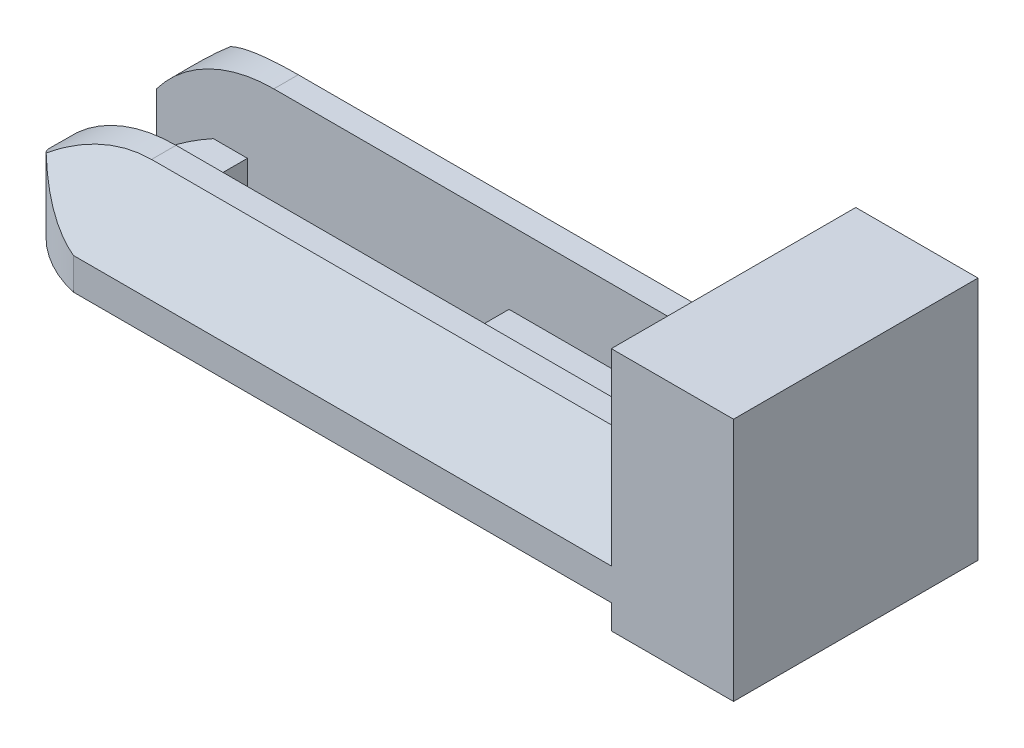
ISO-10303-21;
HEADER;
FILE_DESCRIPTION(('STEP AP214'),'2;1');
FILE_NAME('part.step','',(''),(''),'','','');
FILE_SCHEMA(('AUTOMOTIVE_DESIGN { 1 0 10303 214 1 1 1 1 }'));
ENDSEC;
DATA;
#1=APPLICATION_CONTEXT('core data for automotive mechanical design processes');
#2=APPLICATION_PROTOCOL_DEFINITION('international standard','automotive_design',2000,#1);
#3=PRODUCT_CONTEXT('',#1,'mechanical');
#4=PRODUCT('Part','Part','',(#3));
#5=PRODUCT_RELATED_PRODUCT_CATEGORY('part','',(#4));
#6=PRODUCT_DEFINITION_FORMATION('','',#4);
#7=PRODUCT_DEFINITION_CONTEXT('part definition',#1,'design');
#8=PRODUCT_DEFINITION('design','',#6,#7);
#9=PRODUCT_DEFINITION_SHAPE('','',#8);
#10=(LENGTH_UNIT() NAMED_UNIT(*) SI_UNIT(.MILLI.,.METRE.));
#11=(NAMED_UNIT(*) PLANE_ANGLE_UNIT() SI_UNIT($,.RADIAN.));
#12=(NAMED_UNIT(*) SI_UNIT($,.STERADIAN.) SOLID_ANGLE_UNIT());
#13=UNCERTAINTY_MEASURE_WITH_UNIT(LENGTH_MEASURE(1.E-05),#10,'distance_accuracy_value','');
#14=(GEOMETRIC_REPRESENTATION_CONTEXT(3) GLOBAL_UNCERTAINTY_ASSIGNED_CONTEXT((#13)) GLOBAL_UNIT_ASSIGNED_CONTEXT((#10,
#11,#12)) REPRESENTATION_CONTEXT('',''));
#15=CARTESIAN_POINT('',(0.,0.,0.));
#16=DIRECTION('',(0.,0.,1.));
#17=DIRECTION('',(1.,0.,0.));
#18=AXIS2_PLACEMENT_3D('',#15,#16,#17);
#19=CARTESIAN_POINT('',(1.125,2.3,-5.));
#20=DIRECTION('',(0.,1.,0.));
#21=DIRECTION('',(0.,0.,1.));
#22=AXIS2_PLACEMENT_3D('',#19,#20,#21);
#23=PLANE('',#22);
#24=DIRECTION('',(1.,0.,0.));
#25=VECTOR('',#24,1.);
#26=CARTESIAN_POINT('',(-4.,2.3,-7.));
#27=LINE('',#26,#25);
#28=CARTESIAN_POINT('',(10.8172177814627,2.3,-7.));
#29=VERTEX_POINT('',#28);
#30=CARTESIAN_POINT('',(22.,2.3,-7.));
#31=VERTEX_POINT('',#30);
#32=EDGE_CURVE('E300',#29,#31,#27,.T.);
#33=ORIENTED_EDGE('',*,*,#32,.F.);
#34=DIRECTION('',(0.,0.,-1.));
#35=VECTOR('',#34,1.);
#36=CARTESIAN_POINT('',(10.8172177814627,2.3,-5.));
#37=LINE('',#36,#35);
#38=CARTESIAN_POINT('',(10.8172177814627,2.3,-3.));
#39=VERTEX_POINT('',#38);
#40=EDGE_CURVE('E470',#29,#39,#37,.F.);
#41=ORIENTED_EDGE('',*,*,#40,.T.);
#42=DIRECTION('',(-1.,0.,0.));
#43=VECTOR('',#42,1.);
#44=CARTESIAN_POINT('',(1.125,2.3,-3.));
#45=LINE('',#44,#43);
#46=CARTESIAN_POINT('',(22.,2.3,-3.));
#47=VERTEX_POINT('',#46);
#48=EDGE_CURVE('E327',#47,#39,#45,.T.);
#49=ORIENTED_EDGE('',*,*,#48,.F.);
#50=DIRECTION('',(0.,0.,-1.));
#51=VECTOR('',#50,1.);
#52=CARTESIAN_POINT('',(22.,2.3,0.));
#53=LINE('',#52,#51);
#54=EDGE_CURVE('E291',#47,#31,#53,.T.);
#55=ORIENTED_EDGE('',*,*,#54,.T.);
#56=EDGE_LOOP('',(#33,#41,#49,#55));
#57=FACE_BOUND('',#56,.T.);
#58=ADVANCED_FACE('F34',(#57),#23,.T.);
#59=CARTESIAN_POINT('',(1.125,2.3,-5.));
#60=DIRECTION('',(0.,-1.,0.));
#61=DIRECTION('',(0.,0.,-1.));
#62=AXIS2_PLACEMENT_3D('',#59,#60,#61);
#63=CYLINDRICAL_SURFACE('',#62,5.125);
#64=DIRECTION('',(0.,-1.,0.));
#65=VECTOR('',#64,1.);
#66=CARTESIAN_POINT('',(-3.59364652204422,5.3,-3.));
#67=LINE('',#66,#65);
#68=CARTESIAN_POINT('',(-3.59364652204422,2.91356141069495,-3.));
#69=VERTEX_POINT('',#68);
#70=CARTESIAN_POINT('',(-3.59364652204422,1.,-3.));
#71=VERTEX_POINT('',#70);
#72=EDGE_CURVE('E520',#69,#71,#67,.T.);
#73=ORIENTED_EDGE('',*,*,#72,.T.);
#74=CARTESIAN_POINT('',(1.125,1.,-5.));
#75=DIRECTION('',(0.,1.,0.));
#76=DIRECTION('',(0.,0.,1.));
#77=AXIS2_PLACEMENT_3D('',#74,#75,#76);
#78=CIRCLE('',#77,5.125);
#79=CARTESIAN_POINT('',(0.,1.,0.));
#80=VERTEX_POINT('',#79);
#81=EDGE_CURVE('E299',#71,#80,#78,.T.);
#82=ORIENTED_EDGE('',*,*,#81,.T.);
#83=DIRECTION('',(0.,-1.,0.));
#84=VECTOR('',#83,1.);
#85=CARTESIAN_POINT('',(0.,2.3,0.));
#86=LINE('',#85,#84);
#87=CARTESIAN_POINT('',(0.,2.3,0.));
#88=VERTEX_POINT('',#87);
#89=EDGE_CURVE('E288',#88,#80,#86,.T.);
#90=ORIENTED_EDGE('',*,*,#89,.F.);
#91=CARTESIAN_POINT('',(1.12500000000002,9.80000000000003,-5.00000000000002));
#92=DIRECTION('',(0.,0.554700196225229,0.832050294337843));
#93=DIRECTION('',(0.,-0.832050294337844,0.554700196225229));
#94=AXIS2_PLACEMENT_3D('',#91,#92,#93);
#95=ELLIPSE('',#94,9.23922514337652,5.12500000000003);
#96=CARTESIAN_POINT('',(-2.34544004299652,4.14325539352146,-1.2288369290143));
#97=VERTEX_POINT('',#96);
#98=EDGE_CURVE('E296',#88,#97,#95,.F.);
#99=ORIENTED_EDGE('',*,*,#98,.T.);
#100=CARTESIAN_POINT('',(0.,5.17955945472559,0.));
#101=CARTESIAN_POINT('',(-0.13465374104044,5.15219339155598,-0.0302731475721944));
#102=CARTESIAN_POINT('',(-0.267134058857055,5.12039808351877,-0.0658175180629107));
#103=CARTESIAN_POINT('',(-0.526701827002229,5.04889349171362,-0.146559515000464));
#104=CARTESIAN_POINT('',(-0.653796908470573,5.00919589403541,-0.191742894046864));
#105=CARTESIAN_POINT('',(-0.900609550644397,4.92321211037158,-0.290432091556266));
#106=CARTESIAN_POINT('',(-1.02039192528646,4.87700164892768,-0.343842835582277));
#107=CARTESIAN_POINT('',(-1.2535853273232,4.77857664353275,-0.458541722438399));
#108=CARTESIAN_POINT('',(-1.36699403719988,4.72635993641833,-0.519832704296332));
#109=CARTESIAN_POINT('',(-1.58638369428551,4.61718130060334,-0.649122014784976));
#110=CARTESIAN_POINT('',(-1.69240632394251,4.5602507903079,-0.717076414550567));
#111=CARTESIAN_POINT('',(-1.89761272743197,4.44223933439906,-0.859344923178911));
#112=CARTESIAN_POINT('',(-1.99679727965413,4.38115886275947,-0.933658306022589));
#113=CARTESIAN_POINT('',(-2.18875529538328,4.25536404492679,-1.08848712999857));
#114=CARTESIAN_POINT('',(-2.28149446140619,4.19063315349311,-1.16903154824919));
#115=CARTESIAN_POINT('',(-2.46003025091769,4.05864017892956,-1.33556438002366));
#116=CARTESIAN_POINT('',(-2.54582588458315,3.99137773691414,-1.42155356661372));
#117=CARTESIAN_POINT('',(-2.72993524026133,3.8390825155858,-1.61955027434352));
#118=CARTESIAN_POINT('',(-2.82642772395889,3.75360070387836,-1.73291041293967));
#119=CARTESIAN_POINT('',(-3.00892064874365,3.58171397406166,-1.96711802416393));
#120=CARTESIAN_POINT('',(-3.09492024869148,3.49530898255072,-2.08796609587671));
#121=CARTESIAN_POINT('',(-3.25579890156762,3.32415161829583,-2.33618137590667));
#122=CARTESIAN_POINT('',(-3.33076063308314,3.23939157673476,-2.46348937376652));
#123=CARTESIAN_POINT('',(-3.43531824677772,3.11476433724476,-2.66020646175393));
#124=CARTESIAN_POINT('',(-3.46885952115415,3.07363682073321,-2.72674480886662));
#125=CARTESIAN_POINT('',(-3.53327033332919,2.99259359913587,-2.86183896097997));
#126=CARTESIAN_POINT('',(-3.56413940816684,2.95267810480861,-2.93039511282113));
#127=CARTESIAN_POINT('',(-3.59364652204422,2.91356141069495,-3.));
#128=B_SPLINE_CURVE_WITH_KNOTS('',3,(#100,#101,#102,#103,#104,#105,#106,#107,#108,#109,#110,
#111,#112,#113,#114,#115,#116,#117,#118,#119,#120,#121,#122,#123,#124,#125,#126,#127),
.UNSPECIFIED.,.F.,.F.,(4,2,2,2,2,2,2,2,2,2,2,2,2,4),(0.,0.42180022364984,0.842981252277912,
1.25961706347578,1.67640339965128,2.09060636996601,2.5047621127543,2.92097533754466,
3.33724779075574,3.85171639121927,4.36622620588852,4.87666119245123,5.13192872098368,
5.3872403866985),.UNSPECIFIED.);
#129=EDGE_CURVE('E552',#97,#69,#128,.T.);
#130=ORIENTED_EDGE('',*,*,#129,.T.);
#131=EDGE_LOOP('',(#73,#82,#90,#99,#130));
#132=FACE_BOUND('',#131,.T.);
#133=ADVANCED_FACE('F295',(#132),#63,.T.);
#134=CARTESIAN_POINT('',(0.,1.,-10.));
#135=VERTEX_POINT('',#134);
#136=CARTESIAN_POINT('',(-3.59364652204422,1.,-7.));
#137=VERTEX_POINT('',#136);
#138=EDGE_CURVE('E607',#135,#137,#78,.T.);
#139=ORIENTED_EDGE('',*,*,#138,.T.);
#140=DIRECTION('',(0.,-1.,0.));
#141=VECTOR('',#140,1.);
#142=CARTESIAN_POINT('',(-3.59364652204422,5.3,-7.));
#143=LINE('',#142,#141);
#144=CARTESIAN_POINT('',(-3.59364652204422,2.91356141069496,-7.));
#145=VERTEX_POINT('',#144);
#146=EDGE_CURVE('E516',#145,#137,#143,.T.);
#147=ORIENTED_EDGE('',*,*,#146,.F.);
#148=CARTESIAN_POINT('',(-3.59364652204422,2.91356141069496,-7.));
#149=CARTESIAN_POINT('',(-3.55588890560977,2.96362530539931,-7.08904908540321));
#150=CARTESIAN_POINT('',(-3.51590522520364,3.0149769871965,-7.17639951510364));
#151=CARTESIAN_POINT('',(-3.43158764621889,3.11948906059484,-7.34782692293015));
#152=CARTESIAN_POINT('',(-3.38725486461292,3.17264898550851,-7.43190473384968));
#153=CARTESIAN_POINT('',(-3.29427275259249,3.28009349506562,-7.597042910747));
#154=CARTESIAN_POINT('',(-3.24561893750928,3.33437920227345,-7.67810001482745));
#155=CARTESIAN_POINT('',(-3.14407067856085,3.44343060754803,-7.83717543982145));
#156=CARTESIAN_POINT('',(-3.09117591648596,3.49819634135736,-7.91519353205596));
#157=CARTESIAN_POINT('',(-2.92472262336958,3.66383761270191,-8.14671988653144));
#158=CARTESIAN_POINT('',(-2.80457557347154,3.77466477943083,-8.29560372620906));
#159=CARTESIAN_POINT('',(-2.54687629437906,3.99235392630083,-8.58047288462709));
#160=CARTESIAN_POINT('',(-2.4093365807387,4.09921868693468,-8.71646735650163));
#161=CARTESIAN_POINT('',(-2.16593036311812,4.27096872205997,-8.93092069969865));
#162=CARTESIAN_POINT('',(-2.06496921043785,4.33788474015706,-9.01334722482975));
#163=CARTESIAN_POINT('',(-1.85532280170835,4.46756090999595,-9.17139446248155));
#164=CARTESIAN_POINT('',(-1.74663815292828,4.53032138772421,-9.2470157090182));
#165=CARTESIAN_POINT('',(-1.52246960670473,4.65024609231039,-9.39022635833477));
#166=CARTESIAN_POINT('',(-1.40703955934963,4.70744694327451,-9.45786905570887));
#167=CARTESIAN_POINT('',(-1.16903199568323,4.81570443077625,-9.58489232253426));
#168=CARTESIAN_POINT('',(-1.04645718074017,4.86676336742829,-9.64427598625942));
#169=CARTESIAN_POINT('',(-0.775570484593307,4.96888538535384,-9.76218508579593));
#170=CARTESIAN_POINT('',(-0.626162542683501,5.01879119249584,-9.81923459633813));
#171=CARTESIAN_POINT('',(-0.395951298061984,5.08546898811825,-9.89478467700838));
#172=CARTESIAN_POINT('',(-0.317960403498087,5.10638051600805,-9.91835146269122));
#173=CARTESIAN_POINT('',(-0.160236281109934,5.14523829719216,-9.96190373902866));
#174=CARTESIAN_POINT('',(-0.0805025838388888,5.16318374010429,-9.98188825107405));
#175=CARTESIAN_POINT('',(0.,5.17955945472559,-10.));
#176=B_SPLINE_CURVE_WITH_KNOTS('',3,(#148,#149,#150,#151,#152,#153,#154,#155,#156,#157,#158,
#159,#160,#161,#162,#163,#164,#165,#166,#167,#168,#169,#170,#171,#172,#173,#174,#175),
.UNSPECIFIED.,.F.,.F.,(4,2,2,2,2,2,2,2,2,2,2,2,2,4),(0.,0.326654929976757,0.653226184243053,
0.980140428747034,1.30707922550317,1.96926221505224,2.63097138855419,3.07013006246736,
3.50925424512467,3.94525556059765,4.38109308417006,4.88256386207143,5.13477977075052,
5.38706447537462),.UNSPECIFIED.);
#177=CARTESIAN_POINT('',(-2.34544004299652,4.14325539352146,-8.7711630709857));
#178=VERTEX_POINT('',#177);
#179=EDGE_CURVE('E339',#145,#178,#176,.T.);
#180=ORIENTED_EDGE('',*,*,#179,.T.);
#181=CARTESIAN_POINT('',(1.12500000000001,9.80000000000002,-4.99999999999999));
#182=DIRECTION('',(0.,0.554700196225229,-0.832050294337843));
#183=DIRECTION('',(0.,-0.832050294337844,-0.554700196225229));
#184=AXIS2_PLACEMENT_3D('',#181,#182,#183);
#185=ELLIPSE('',#184,9.2392251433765,5.12500000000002);
#186=CARTESIAN_POINT('',(0.,2.3,-10.));
#187=VERTEX_POINT('',#186);
#188=EDGE_CURVE('E347',#178,#187,#185,.F.);
#189=ORIENTED_EDGE('',*,*,#188,.T.);
#190=DIRECTION('',(0.,-1.,0.));
#191=VECTOR('',#190,1.);
#192=CARTESIAN_POINT('',(0.,2.3,-10.));
#193=LINE('',#192,#191);
#194=EDGE_CURVE('E301',#187,#135,#193,.T.);
#195=ORIENTED_EDGE('',*,*,#194,.T.);
#196=EDGE_LOOP('',(#139,#147,#180,#189,#195));
#197=FACE_BOUND('',#196,.T.);
#198=ADVANCED_FACE('F424',(#197),#63,.T.);
#199=CARTESIAN_POINT('',(0.,2.3,0.));
#200=DIRECTION('',(0.,0.,-1.));
#201=DIRECTION('',(-1.,0.,0.));
#202=AXIS2_PLACEMENT_3D('',#199,#200,#201);
#203=PLANE('',#202);
#204=ORIENTED_EDGE('',*,*,#89,.T.);
#205=DIRECTION('',(1.,0.,0.));
#206=VECTOR('',#205,1.);
#207=CARTESIAN_POINT('',(0.,1.,0.));
#208=LINE('',#207,#206);
#209=CARTESIAN_POINT('',(22.,1.,0.));
#210=VERTEX_POINT('',#209);
#211=EDGE_CURVE('E546',#80,#210,#208,.T.);
#212=ORIENTED_EDGE('',*,*,#211,.T.);
#213=DIRECTION('',(0.,-1.,0.));
#214=VECTOR('',#213,1.);
#215=CARTESIAN_POINT('',(22.,10.,0.));
#216=LINE('',#215,#214);
#217=CARTESIAN_POINT('',(22.,0.,0.));
#218=VERTEX_POINT('',#217);
#219=EDGE_CURVE('E234',#210,#218,#216,.T.);
#220=ORIENTED_EDGE('',*,*,#219,.T.);
#221=DIRECTION('',(-1.,0.,0.));
#222=VECTOR('',#221,1.);
#223=CARTESIAN_POINT('',(27.,0.,0.));
#224=LINE('',#223,#222);
#225=CARTESIAN_POINT('',(27.,0.,0.));
#226=VERTEX_POINT('',#225);
#227=EDGE_CURVE('E213',#226,#218,#224,.T.);
#228=ORIENTED_EDGE('',*,*,#227,.F.);
#229=DIRECTION('',(0.,-1.,0.));
#230=VECTOR('',#229,1.);
#231=CARTESIAN_POINT('',(27.,10.,0.));
#232=LINE('',#231,#230);
#233=CARTESIAN_POINT('',(27.,10.,0.));
#234=VERTEX_POINT('',#233);
#235=EDGE_CURVE('E219',#234,#226,#232,.T.);
#236=ORIENTED_EDGE('',*,*,#235,.F.);
#237=DIRECTION('',(-1.,0.,0.));
#238=VECTOR('',#237,1.);
#239=CARTESIAN_POINT('',(27.,10.,0.));
#240=LINE('',#239,#238);
#241=CARTESIAN_POINT('',(22.,10.,0.));
#242=VERTEX_POINT('',#241);
#243=EDGE_CURVE('E273',#234,#242,#240,.T.);
#244=ORIENTED_EDGE('',*,*,#243,.T.);
#245=CARTESIAN_POINT('',(22.,2.3,0.));
#246=VERTEX_POINT('',#245);
#247=EDGE_CURVE('E244',#242,#246,#216,.T.);
#248=ORIENTED_EDGE('',*,*,#247,.T.);
#249=DIRECTION('',(1.,0.,0.));
#250=VECTOR('',#249,1.);
#251=CARTESIAN_POINT('',(0.,2.3,0.));
#252=LINE('',#251,#250);
#253=EDGE_CURVE('E286',#88,#246,#252,.T.);
#254=ORIENTED_EDGE('',*,*,#253,.F.);
#255=EDGE_LOOP('',(#204,#212,#220,#228,#236,#244,#248,#254));
#256=FACE_BOUND('',#255,.T.);
#257=ADVANCED_FACE('F231',(#256),#203,.F.);
#258=CARTESIAN_POINT('',(0.,2.3,-10.));
#259=DIRECTION('',(0.,0.,1.));
#260=DIRECTION('',(1.,0.,0.));
#261=AXIS2_PLACEMENT_3D('',#258,#259,#260);
#262=PLANE('',#261);
#263=DIRECTION('',(-1.,0.,0.));
#264=VECTOR('',#263,1.);
#265=CARTESIAN_POINT('',(0.,2.3,-10.));
#266=LINE('',#265,#264);
#267=CARTESIAN_POINT('',(22.,2.3,-10.));
#268=VERTEX_POINT('',#267);
#269=EDGE_CURVE('E306',#268,#187,#266,.T.);
#270=ORIENTED_EDGE('',*,*,#269,.F.);
#271=DIRECTION('',(0.,1.,0.));
#272=VECTOR('',#271,1.);
#273=CARTESIAN_POINT('',(22.,0.,-10.));
#274=LINE('',#273,#272);
#275=CARTESIAN_POINT('',(22.,10.,-10.));
#276=VERTEX_POINT('',#275);
#277=EDGE_CURVE('E264',#268,#276,#274,.T.);
#278=ORIENTED_EDGE('',*,*,#277,.T.);
#279=DIRECTION('',(-1.,0.,0.));
#280=VECTOR('',#279,1.);
#281=CARTESIAN_POINT('',(27.,10.,-10.));
#282=LINE('',#281,#280);
#283=CARTESIAN_POINT('',(27.,10.,-10.));
#284=VERTEX_POINT('',#283);
#285=EDGE_CURVE('E240',#284,#276,#282,.T.);
#286=ORIENTED_EDGE('',*,*,#285,.F.);
#287=DIRECTION('',(0.,1.,0.));
#288=VECTOR('',#287,1.);
#289=CARTESIAN_POINT('',(27.,0.,-10.));
#290=LINE('',#289,#288);
#291=CARTESIAN_POINT('',(27.,0.,-10.));
#292=VERTEX_POINT('',#291);
#293=EDGE_CURVE('E218',#292,#284,#290,.T.);
#294=ORIENTED_EDGE('',*,*,#293,.F.);
#295=DIRECTION('',(-1.,0.,0.));
#296=VECTOR('',#295,1.);
#297=CARTESIAN_POINT('',(27.,0.,-10.));
#298=LINE('',#297,#296);
#299=CARTESIAN_POINT('',(22.,0.,-10.));
#300=VERTEX_POINT('',#299);
#301=EDGE_CURVE('E215',#292,#300,#298,.T.);
#302=ORIENTED_EDGE('',*,*,#301,.T.);
#303=CARTESIAN_POINT('',(22.,1.,-10.));
#304=VERTEX_POINT('',#303);
#305=EDGE_CURVE('E265',#300,#304,#274,.T.);
#306=ORIENTED_EDGE('',*,*,#305,.T.);
#307=DIRECTION('',(-1.,0.,0.));
#308=VECTOR('',#307,1.);
#309=CARTESIAN_POINT('',(0.,1.,-10.));
#310=LINE('',#309,#308);
#311=EDGE_CURVE('E547',#304,#135,#310,.T.);
#312=ORIENTED_EDGE('',*,*,#311,.T.);
#313=ORIENTED_EDGE('',*,*,#194,.F.);
#314=EDGE_LOOP('',(#270,#278,#286,#294,#302,#306,#312,#313));
#315=FACE_BOUND('',#314,.T.);
#316=ADVANCED_FACE('F429',(#315),#262,.F.);
#317=DIRECTION('',(0.,0.,1.));
#318=VECTOR('',#317,1.);
#319=CARTESIAN_POINT('',(0.11721778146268,2.3,-5.));
#320=LINE('',#319,#318);
#321=CARTESIAN_POINT('',(0.11721778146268,2.3,-7.));
#322=VERTEX_POINT('',#321);
#323=CARTESIAN_POINT('',(0.117217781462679,2.3,-3.));
#324=VERTEX_POINT('',#323);
#325=EDGE_CURVE('E442',#322,#324,#320,.T.);
#326=ORIENTED_EDGE('',*,*,#325,.F.);
#327=CARTESIAN_POINT('',(-1.27617158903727,2.3,-7.));
#328=VERTEX_POINT('',#327);
#329=EDGE_CURVE('E303',#328,#322,#27,.T.);
#330=ORIENTED_EDGE('',*,*,#329,.F.);
#331=CARTESIAN_POINT('',(1.125,2.3,-5.));
#332=DIRECTION('',(0.,1.,0.));
#333=DIRECTION('',(0.,0.,1.));
#334=AXIS2_PLACEMENT_3D('',#331,#332,#333);
#335=CIRCLE('',#334,3.12499999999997);
#336=CARTESIAN_POINT('',(-1.27617158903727,2.3,-3.));
#337=VERTEX_POINT('',#336);
#338=EDGE_CURVE('E461',#328,#337,#335,.T.);
#339=ORIENTED_EDGE('',*,*,#338,.T.);
#340=EDGE_CURVE('E331',#324,#337,#45,.T.);
#341=ORIENTED_EDGE('',*,*,#340,.F.);
#342=EDGE_LOOP('',(#326,#330,#339,#341));
#343=FACE_BOUND('',#342,.T.);
#344=ADVANCED_FACE('F420',(#343),#23,.T.);
#345=CARTESIAN_POINT('',(1.125,0.,-5.));
#346=DIRECTION('',(0.,1.,0.));
#347=DIRECTION('',(0.,0.,1.));
#348=AXIS2_PLACEMENT_3D('',#345,#346,#347);
#349=PLANE('',#348);
#350=DIRECTION('',(0.,0.,-1.));
#351=VECTOR('',#350,1.);
#352=CARTESIAN_POINT('',(0.11721778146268,0.,-3.));
#353=LINE('',#352,#351);
#354=CARTESIAN_POINT('',(0.11721778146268,0.,-2.));
#355=VERTEX_POINT('',#354);
#356=CARTESIAN_POINT('',(0.11721778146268,0.,-8.));
#357=VERTEX_POINT('',#356);
#358=EDGE_CURVE('E236',#355,#357,#353,.T.);
#359=ORIENTED_EDGE('',*,*,#358,.F.);
#360=DIRECTION('',(1.,0.,0.));
#361=VECTOR('',#360,1.);
#362=CARTESIAN_POINT('',(13.1172177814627,0.,-2.));
#363=LINE('',#362,#361);
#364=CARTESIAN_POINT('',(13.1172177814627,0.,-2.));
#365=VERTEX_POINT('',#364);
#366=EDGE_CURVE('E483',#355,#365,#363,.T.);
#367=ORIENTED_EDGE('',*,*,#366,.T.);
#368=DIRECTION('',(0.,0.,-1.));
#369=VECTOR('',#368,1.);
#370=CARTESIAN_POINT('',(13.1172177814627,0.,-5.));
#371=LINE('',#370,#369);
#372=CARTESIAN_POINT('',(13.1172177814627,0.,-8.));
#373=VERTEX_POINT('',#372);
#374=EDGE_CURVE('E469',#365,#373,#371,.T.);
#375=ORIENTED_EDGE('',*,*,#374,.T.);
#376=DIRECTION('',(-1.,0.,0.));
#377=VECTOR('',#376,1.);
#378=CARTESIAN_POINT('',(0.11721778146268,0.,-8.));
#379=LINE('',#378,#377);
#380=EDGE_CURVE('E480',#373,#357,#379,.T.);
#381=ORIENTED_EDGE('',*,*,#380,.T.);
#382=EDGE_LOOP('',(#359,#367,#375,#381));
#383=FACE_BOUND('',#382,.T.);
#384=DIRECTION('',(1.,0.,0.));
#385=VECTOR('',#384,1.);
#386=CARTESIAN_POINT('',(1.125,0.,-8.99999999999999));
#387=LINE('',#386,#385);
#388=CARTESIAN_POINT('',(0.11721778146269,0.,-8.99999999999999));
#389=VERTEX_POINT('',#388);
#390=CARTESIAN_POINT('',(22.,0.,-8.99999999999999));
#391=VERTEX_POINT('',#390);
#392=EDGE_CURVE('E569',#389,#391,#387,.T.);
#393=ORIENTED_EDGE('',*,*,#392,.T.);
#394=DIRECTION('',(0.,0.,-1.));
#395=VECTOR('',#394,1.);
#396=CARTESIAN_POINT('',(22.,0.,0.));
#397=LINE('',#396,#395);
#398=EDGE_CURVE('E248',#391,#300,#397,.T.);
#399=ORIENTED_EDGE('',*,*,#398,.T.);
#400=ORIENTED_EDGE('',*,*,#301,.F.);
#401=DIRECTION('',(0.,0.,-1.));
#402=VECTOR('',#401,1.);
#403=CARTESIAN_POINT('',(27.,0.,0.));
#404=LINE('',#403,#402);
#405=EDGE_CURVE('E208',#226,#292,#404,.T.);
#406=ORIENTED_EDGE('',*,*,#405,.F.);
#407=ORIENTED_EDGE('',*,*,#227,.T.);
#408=CARTESIAN_POINT('',(22.,0.,-1.00000000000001));
#409=VERTEX_POINT('',#408);
#410=EDGE_CURVE('E262',#218,#409,#397,.T.);
#411=ORIENTED_EDGE('',*,*,#410,.T.);
#412=DIRECTION('',(-1.,0.,0.));
#413=VECTOR('',#412,1.);
#414=CARTESIAN_POINT('',(1.125,0.,-1.00000000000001));
#415=LINE('',#414,#413);
#416=CARTESIAN_POINT('',(0.117217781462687,0.,-1.00000000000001));
#417=VERTEX_POINT('',#416);
#418=EDGE_CURVE('E567',#409,#417,#415,.T.);
#419=ORIENTED_EDGE('',*,*,#418,.T.);
#420=CARTESIAN_POINT('',(1.125,0.,-5.));
#421=DIRECTION('',(0.,1.,0.));
#422=DIRECTION('',(0.,0.,1.));
#423=AXIS2_PLACEMENT_3D('',#420,#421,#422);
#424=CIRCLE('',#423,4.12499999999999);
#425=EDGE_CURVE('E559',#417,#389,#424,.F.);
#426=ORIENTED_EDGE('',*,*,#425,.T.);
#427=EDGE_LOOP('',(#393,#399,#400,#406,#407,#411,#419,#426));
#428=FACE_BOUND('',#427,.T.);
#429=ADVANCED_FACE('F210',(#383,#428),#349,.F.);
#430=CARTESIAN_POINT('',(-4.,5.3,-8.));
#431=DIRECTION('',(0.,0.554700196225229,-0.832050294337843));
#432=DIRECTION('',(0.,0.832050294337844,0.554700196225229));
#433=AXIS2_PLACEMENT_3D('',#430,#431,#432);
#434=PLANE('',#433);
#435=ORIENTED_EDGE('',*,*,#188,.F.);
#436=CARTESIAN_POINT('',(1.19615242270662,-0.700000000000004,-12.));
#437=DIRECTION('',(0.,0.554700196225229,-0.832050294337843));
#438=DIRECTION('',(0.,-0.832050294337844,-0.554700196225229));
#439=AXIS2_PLACEMENT_3D('',#436,#437,#438);
#440=ELLIPSE('',#439,7.21110255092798,6.);
#441=CARTESIAN_POINT('',(1.19615242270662,5.3,-8.));
#442=VERTEX_POINT('',#441);
#443=EDGE_CURVE('E337',#178,#442,#440,.T.);
#444=ORIENTED_EDGE('',*,*,#443,.T.);
#445=DIRECTION('',(1.,0.,0.));
#446=VECTOR('',#445,1.);
#447=CARTESIAN_POINT('',(-4.,5.3,-8.));
#448=LINE('',#447,#446);
#449=CARTESIAN_POINT('',(22.,5.3,-8.));
#450=VERTEX_POINT('',#449);
#451=EDGE_CURVE('E315',#442,#450,#448,.T.);
#452=ORIENTED_EDGE('',*,*,#451,.T.);
#453=DIRECTION('',(0.,0.832050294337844,0.554700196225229));
#454=VECTOR('',#453,1.);
#455=CARTESIAN_POINT('',(22.,5.3,-8.));
#456=LINE('',#455,#454);
#457=EDGE_CURVE('E503',#268,#450,#456,.T.);
#458=ORIENTED_EDGE('',*,*,#457,.F.);
#459=ORIENTED_EDGE('',*,*,#269,.T.);
#460=EDGE_LOOP('',(#435,#444,#452,#458,#459));
#461=FACE_BOUND('',#460,.T.);
#462=ADVANCED_FACE('F435',(#461),#434,.T.);
#463=CARTESIAN_POINT('',(-4.,5.3,-7.));
#464=DIRECTION('',(0.,0.,1.));
#465=DIRECTION('',(0.,-1.,0.));
#466=AXIS2_PLACEMENT_3D('',#463,#464,#465);
#467=PLANE('',#466);
#468=DIRECTION('',(0.,-1.,0.));
#469=VECTOR('',#468,1.);
#470=CARTESIAN_POINT('',(0.11721778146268,3.,-7.));
#471=LINE('',#470,#469);
#472=CARTESIAN_POINT('',(0.11721778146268,0.999999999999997,-7.));
#473=VERTEX_POINT('',#472);
#474=EDGE_CURVE('E448',#322,#473,#471,.T.);
#475=ORIENTED_EDGE('',*,*,#474,.T.);
#476=DIRECTION('',(1.,0.,0.));
#477=VECTOR('',#476,1.);
#478=CARTESIAN_POINT('',(13.1172177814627,0.999999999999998,-7.));
#479=LINE('',#478,#477);
#480=CARTESIAN_POINT('',(12.1172177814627,0.999999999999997,-7.));
#481=VERTEX_POINT('',#480);
#482=EDGE_CURVE('E486',#473,#481,#479,.T.);
#483=ORIENTED_EDGE('',*,*,#482,.T.);
#484=DIRECTION('',(0.707106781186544,-0.707106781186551,0.));
#485=VECTOR('',#484,1.);
#486=CARTESIAN_POINT('',(10.1172177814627,3.00000000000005,-7.));
#487=LINE('',#486,#485);
#488=EDGE_CURVE('E475',#481,#29,#487,.F.);
#489=ORIENTED_EDGE('',*,*,#488,.T.);
#490=ORIENTED_EDGE('',*,*,#32,.T.);
#491=DIRECTION('',(0.,-1.,0.));
#492=VECTOR('',#491,1.);
#493=CARTESIAN_POINT('',(22.,5.3,-7.));
#494=LINE('',#493,#492);
#495=CARTESIAN_POINT('',(22.,5.3,-7.));
#496=VERTEX_POINT('',#495);
#497=EDGE_CURVE('E312',#496,#31,#494,.T.);
#498=ORIENTED_EDGE('',*,*,#497,.F.);
#499=DIRECTION('',(1.,0.,0.));
#500=VECTOR('',#499,1.);
#501=CARTESIAN_POINT('',(-4.,5.3,-7.));
#502=LINE('',#501,#500);
#503=CARTESIAN_POINT('',(1.19615242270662,5.3,-7.));
#504=VERTEX_POINT('',#503);
#505=EDGE_CURVE('E292',#504,#496,#502,.T.);
#506=ORIENTED_EDGE('',*,*,#505,.F.);
#507=CARTESIAN_POINT('',(1.19615242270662,-0.700000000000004,-7.));
#508=DIRECTION('',(0.,0.,1.));
#509=DIRECTION('',(0.,-1.,0.));
#510=AXIS2_PLACEMENT_3D('',#507,#508,#509);
#511=CIRCLE('',#510,6.);
#512=EDGE_CURVE('E334',#504,#145,#511,.T.);
#513=ORIENTED_EDGE('',*,*,#512,.T.);
#514=ORIENTED_EDGE('',*,*,#146,.T.);
#515=CARTESIAN_POINT('',(-3.21096874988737,0.649999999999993,-7.));
#516=CARTESIAN_POINT('',(-3.27494911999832,0.708113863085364,-7.));
#517=CARTESIAN_POINT('',(-3.33882912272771,0.766337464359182,-7.));
#518=CARTESIAN_POINT('',(-3.4663883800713,0.8830041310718,-7.));
#519=CARTESIAN_POINT('',(-3.53006763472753,0.941447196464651,-7.));
#520=CARTESIAN_POINT('',(-3.59364652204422,1.,-7.));
#521=B_SPLINE_CURVE_WITH_KNOTS('',3,(#515,#516,#517,#518,#519,#520),.UNSPECIFIED.,.F.,.F.,(4,2,
4),(0.,0.259298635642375,0.51859721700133),.UNSPECIFIED.);
#522=CARTESIAN_POINT('',(-3.21096874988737,0.649999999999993,-7.));
#523=VERTEX_POINT('',#522);
#524=EDGE_CURVE('E598',#523,#137,#521,.T.);
#525=ORIENTED_EDGE('',*,*,#524,.F.);
#526=CARTESIAN_POINT('',(-3.59364652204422,0.299999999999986,-7.));
#527=CARTESIAN_POINT('',(-3.49977902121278,0.386422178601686,-7.));
#528=CARTESIAN_POINT('',(-3.40571960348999,0.472635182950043,-7.));
#529=CARTESIAN_POINT('',(-3.2171379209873,0.64455429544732,-7.));
#530=CARTESIAN_POINT('',(-3.1226156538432,0.730260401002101,-7.));
#531=CARTESIAN_POINT('',(-2.83831988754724,0.986409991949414,-7.));
#532=CARTESIAN_POINT('',(-2.64773597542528,1.15596001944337,-7.));
#533=CARTESIAN_POINT('',(-2.35947284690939,1.40761530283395,-7.));
#534=CARTESIAN_POINT('',(-2.26297114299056,1.49106898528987,-7.));
#535=CARTESIAN_POINT('',(-2.06899654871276,1.65683398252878,-7.));
#536=CARTESIAN_POINT('',(-1.97152369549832,1.73914534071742,-7.));
#537=CARTESIAN_POINT('',(-1.77533522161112,1.9023654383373,-7.));
#538=CARTESIAN_POINT('',(-1.67661908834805,1.98327356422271,-7.));
#539=CARTESIAN_POINT('',(-1.47763770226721,2.1431863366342,-7.));
#540=CARTESIAN_POINT('',(-1.37737224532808,2.22219072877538,-7.));
#541=CARTESIAN_POINT('',(-1.27617158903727,2.3,-7.));
#542=B_SPLINE_CURVE_WITH_KNOTS('',3,(#526,#527,#528,#529,#530,#531,#532,#533,#534,#535,#536,
#537,#538,#539,#540,#541),.UNSPECIFIED.,.F.,.F.,(4,2,2,2,2,2,2,4),(0.,0.382776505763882,
0.765554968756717,1.53077920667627,1.91351763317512,2.29624147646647,2.67912864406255,
3.06206669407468),.UNSPECIFIED.);
#543=EDGE_CURVE('E389',#523,#328,#542,.T.);
#544=ORIENTED_EDGE('',*,*,#543,.T.);
#545=ORIENTED_EDGE('',*,*,#329,.T.);
#546=EDGE_LOOP('',(#475,#483,#489,#490,#498,#506,#513,#514,#525,#544,#545));
#547=FACE_BOUND('',#546,.T.);
#548=ADVANCED_FACE('F371',(#547),#467,.T.);
#549=CARTESIAN_POINT('',(-4.,5.3,-7.));
#550=DIRECTION('',(0.,1.,0.));
#551=DIRECTION('',(0.,0.,1.));
#552=AXIS2_PLACEMENT_3D('',#549,#550,#551);
#553=PLANE('',#552);
#554=ORIENTED_EDGE('',*,*,#451,.F.);
#555=DIRECTION('',(0.,0.,1.));
#556=VECTOR('',#555,1.);
#557=CARTESIAN_POINT('',(1.19615242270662,5.3,-6.99999999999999));
#558=LINE('',#557,#556);
#559=EDGE_CURVE('E330',#442,#504,#558,.T.);
#560=ORIENTED_EDGE('',*,*,#559,.T.);
#561=ORIENTED_EDGE('',*,*,#505,.T.);
#562=DIRECTION('',(0.,0.,1.));
#563=VECTOR('',#562,1.);
#564=CARTESIAN_POINT('',(22.,5.3,-7.));
#565=LINE('',#564,#563);
#566=EDGE_CURVE('E316',#450,#496,#565,.T.);
#567=ORIENTED_EDGE('',*,*,#566,.F.);
#568=EDGE_LOOP('',(#554,#560,#561,#567));
#569=FACE_BOUND('',#568,.T.);
#570=ADVANCED_FACE('F362',(#569),#553,.T.);
#571=CARTESIAN_POINT('',(-4.,5.3,-2.));
#572=DIRECTION('',(0.,0.554700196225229,0.832050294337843));
#573=DIRECTION('',(0.,-0.832050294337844,0.554700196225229));
#574=AXIS2_PLACEMENT_3D('',#571,#572,#573);
#575=PLANE('',#574);
#576=ORIENTED_EDGE('',*,*,#98,.F.);
#577=ORIENTED_EDGE('',*,*,#253,.T.);
#578=DIRECTION('',(0.,-0.832050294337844,0.554700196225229));
#579=VECTOR('',#578,1.);
#580=CARTESIAN_POINT('',(22.,5.3,-2.));
#581=LINE('',#580,#579);
#582=CARTESIAN_POINT('',(22.,5.3,-2.));
#583=VERTEX_POINT('',#582);
#584=EDGE_CURVE('E284',#583,#246,#581,.T.);
#585=ORIENTED_EDGE('',*,*,#584,.F.);
#586=DIRECTION('',(1.,0.,0.));
#587=VECTOR('',#586,1.);
#588=CARTESIAN_POINT('',(-4.,5.3,-2.));
#589=LINE('',#588,#587);
#590=CARTESIAN_POINT('',(1.19615242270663,5.3,-2.));
#591=VERTEX_POINT('',#590);
#592=EDGE_CURVE('E502',#591,#583,#589,.T.);
#593=ORIENTED_EDGE('',*,*,#592,.F.);
#594=CARTESIAN_POINT('',(1.19615242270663,-0.699999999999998,2.));
#595=DIRECTION('',(0.,0.554700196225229,0.832050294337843));
#596=DIRECTION('',(0.,-0.832050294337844,0.554700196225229));
#597=AXIS2_PLACEMENT_3D('',#594,#595,#596);
#598=ELLIPSE('',#597,7.21110255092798,6.);
#599=EDGE_CURVE('E572',#591,#97,#598,.T.);
#600=ORIENTED_EDGE('',*,*,#599,.T.);
#601=EDGE_LOOP('',(#576,#577,#585,#593,#600));
#602=FACE_BOUND('',#601,.T.);
#603=ADVANCED_FACE('F358',(#602),#575,.T.);
#604=CARTESIAN_POINT('',(-4.,5.3,-3.));
#605=DIRECTION('',(0.,1.,0.));
#606=DIRECTION('',(0.,0.,1.));
#607=AXIS2_PLACEMENT_3D('',#604,#605,#606);
#608=PLANE('',#607);
#609=DIRECTION('',(1.,0.,0.));
#610=VECTOR('',#609,1.);
#611=CARTESIAN_POINT('',(-4.,5.3,-3.));
#612=LINE('',#611,#610);
#613=CARTESIAN_POINT('',(1.19615242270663,5.3,-3.));
#614=VERTEX_POINT('',#613);
#615=CARTESIAN_POINT('',(22.,5.3,-3.));
#616=VERTEX_POINT('',#615);
#617=EDGE_CURVE('E495',#614,#616,#612,.T.);
#618=ORIENTED_EDGE('',*,*,#617,.F.);
#619=DIRECTION('',(0.,0.,-1.));
#620=VECTOR('',#619,1.);
#621=CARTESIAN_POINT('',(1.19615242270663,5.3,-2.));
#622=LINE('',#621,#620);
#623=EDGE_CURVE('E346',#614,#591,#622,.F.);
#624=ORIENTED_EDGE('',*,*,#623,.T.);
#625=ORIENTED_EDGE('',*,*,#592,.T.);
#626=DIRECTION('',(0.,0.,1.));
#627=VECTOR('',#626,1.);
#628=CARTESIAN_POINT('',(22.,5.3,-3.));
#629=LINE('',#628,#627);
#630=EDGE_CURVE('E496',#616,#583,#629,.T.);
#631=ORIENTED_EDGE('',*,*,#630,.F.);
#632=EDGE_LOOP('',(#618,#624,#625,#631));
#633=FACE_BOUND('',#632,.T.);
#634=ADVANCED_FACE('F361',(#633),#608,.T.);
#635=CARTESIAN_POINT('',(-4.,5.3,-3.));
#636=DIRECTION('',(0.,0.,-1.));
#637=DIRECTION('',(-1.,0.,0.));
#638=AXIS2_PLACEMENT_3D('',#635,#636,#637);
#639=PLANE('',#638);
#640=DIRECTION('',(-0.707106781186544,0.707106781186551,0.));
#641=VECTOR('',#640,1.);
#642=CARTESIAN_POINT('',(10.1172177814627,3.00000000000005,-3.));
#643=LINE('',#642,#641);
#644=CARTESIAN_POINT('',(12.1172177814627,0.999999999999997,-3.));
#645=VERTEX_POINT('',#644);
#646=EDGE_CURVE('E472',#39,#645,#643,.F.);
#647=ORIENTED_EDGE('',*,*,#646,.T.);
#648=DIRECTION('',(-1.,0.,0.));
#649=VECTOR('',#648,1.);
#650=CARTESIAN_POINT('',(0.11721778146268,0.999999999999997,-3.));
#651=LINE('',#650,#649);
#652=CARTESIAN_POINT('',(0.11721778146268,0.999999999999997,-3.));
#653=VERTEX_POINT('',#652);
#654=EDGE_CURVE('E477',#645,#653,#651,.T.);
#655=ORIENTED_EDGE('',*,*,#654,.T.);
#656=DIRECTION('',(0.,-1.,0.));
#657=VECTOR('',#656,1.);
#658=CARTESIAN_POINT('',(0.11721778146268,3.,-3.));
#659=LINE('',#658,#657);
#660=EDGE_CURVE('E238',#324,#653,#659,.T.);
#661=ORIENTED_EDGE('',*,*,#660,.F.);
#662=ORIENTED_EDGE('',*,*,#340,.T.);
#663=CARTESIAN_POINT('',(-1.27617158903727,2.3,-3.));
#664=CARTESIAN_POINT('',(-1.37737224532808,2.22219072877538,-3.));
#665=CARTESIAN_POINT('',(-1.47763770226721,2.1431863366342,-3.));
#666=CARTESIAN_POINT('',(-1.67661908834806,1.98327356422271,-3.));
#667=CARTESIAN_POINT('',(-1.77533522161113,1.9023654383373,-3.));
#668=CARTESIAN_POINT('',(-1.97152369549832,1.73914534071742,-3.));
#669=CARTESIAN_POINT('',(-2.06899654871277,1.65683398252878,-3.));
#670=CARTESIAN_POINT('',(-2.26297114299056,1.49106898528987,-3.));
#671=CARTESIAN_POINT('',(-2.35947284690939,1.40761530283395,-3.));
#672=CARTESIAN_POINT('',(-2.64773597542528,1.15596001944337,-3.));
#673=CARTESIAN_POINT('',(-2.83831988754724,0.986409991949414,-3.));
#674=CARTESIAN_POINT('',(-3.1226156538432,0.730260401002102,-3.));
#675=CARTESIAN_POINT('',(-3.2171379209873,0.644554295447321,-3.));
#676=CARTESIAN_POINT('',(-3.40571960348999,0.472635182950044,-3.));
#677=CARTESIAN_POINT('',(-3.49977902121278,0.386422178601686,-3.));
#678=CARTESIAN_POINT('',(-3.59364652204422,0.299999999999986,-3.));
#679=B_SPLINE_CURVE_WITH_KNOTS('',3,(#663,#664,#665,#666,#667,#668,#669,#670,#671,#672,#673,
#674,#675,#676,#677,#678),.UNSPECIFIED.,.F.,.F.,(4,2,2,2,2,2,2,4),(0.,0.382938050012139,
0.765825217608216,1.14854906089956,1.53128748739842,2.29651172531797,2.6792901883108,
3.06206669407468),.UNSPECIFIED.);
#680=CARTESIAN_POINT('',(-3.21096874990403,0.650000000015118,-3.));
#681=VERTEX_POINT('',#680);
#682=EDGE_CURVE('E383',#337,#681,#679,.T.);
#683=ORIENTED_EDGE('',*,*,#682,.T.);
#684=CARTESIAN_POINT('',(-3.59364652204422,1.,-3.));
#685=CARTESIAN_POINT('',(-3.53006763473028,0.941447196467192,-3.));
#686=CARTESIAN_POINT('',(-3.46638838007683,0.883004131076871,-3.));
#687=CARTESIAN_POINT('',(-3.33882912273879,0.766337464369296,-3.));
#688=CARTESIAN_POINT('',(-3.27494912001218,0.708113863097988,-3.));
#689=CARTESIAN_POINT('',(-3.21096874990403,0.650000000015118,-3.));
#690=B_SPLINE_CURVE_WITH_KNOTS('',3,(#684,#685,#686,#687,#688,#689),.UNSPECIFIED.,.F.,.F.,(4,2,
4),(0.,0.259298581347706,0.518597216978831),.UNSPECIFIED.);
#691=EDGE_CURVE('E376',#71,#681,#690,.T.);
#692=ORIENTED_EDGE('',*,*,#691,.F.);
#693=ORIENTED_EDGE('',*,*,#72,.F.);
#694=CARTESIAN_POINT('',(1.19615242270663,-0.699999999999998,-3.));
#695=DIRECTION('',(0.,0.,-1.));
#696=DIRECTION('',(-1.,0.,0.));
#697=AXIS2_PLACEMENT_3D('',#694,#695,#696);
#698=CIRCLE('',#697,6.);
#699=EDGE_CURVE('E512',#69,#614,#698,.T.);
#700=ORIENTED_EDGE('',*,*,#699,.T.);
#701=ORIENTED_EDGE('',*,*,#617,.T.);
#702=DIRECTION('',(0.,1.,0.));
#703=VECTOR('',#702,1.);
#704=CARTESIAN_POINT('',(22.,5.3,-3.));
#705=LINE('',#704,#703);
#706=EDGE_CURVE('E508',#47,#616,#705,.T.);
#707=ORIENTED_EDGE('',*,*,#706,.F.);
#708=ORIENTED_EDGE('',*,*,#48,.T.);
#709=EDGE_LOOP('',(#647,#655,#661,#662,#683,#692,#693,#700,#701,#707,#708));
#710=FACE_BOUND('',#709,.T.);
#711=ADVANCED_FACE('F365',(#710),#639,.T.);
#712=CARTESIAN_POINT('',(1.19615242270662,-0.700000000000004,0.));
#713=DIRECTION('',(0.,0.,-1.));
#714=DIRECTION('',(-1.,0.,0.));
#715=AXIS2_PLACEMENT_3D('',#712,#713,#714);
#716=CYLINDRICAL_SURFACE('',#715,6.);
#717=ORIENTED_EDGE('',*,*,#179,.F.);
#718=ORIENTED_EDGE('',*,*,#512,.F.);
#719=ORIENTED_EDGE('',*,*,#559,.F.);
#720=ORIENTED_EDGE('',*,*,#443,.F.);
#721=EDGE_LOOP('',(#717,#718,#719,#720));
#722=FACE_BOUND('',#721,.T.);
#723=ADVANCED_FACE('F349',(#722),#716,.T.);
#724=CARTESIAN_POINT('',(1.19615242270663,-0.699999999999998,0.));
#725=DIRECTION('',(0.,0.,1.));
#726=DIRECTION('',(1.,0.,0.));
#727=AXIS2_PLACEMENT_3D('',#724,#725,#726);
#728=CYLINDRICAL_SURFACE('',#727,6.);
#729=ORIENTED_EDGE('',*,*,#129,.F.);
#730=ORIENTED_EDGE('',*,*,#599,.F.);
#731=ORIENTED_EDGE('',*,*,#623,.F.);
#732=ORIENTED_EDGE('',*,*,#699,.F.);
#733=EDGE_LOOP('',(#729,#730,#731,#732));
#734=FACE_BOUND('',#733,.T.);
#735=ADVANCED_FACE('F578',(#734),#728,.T.);
#736=CARTESIAN_POINT('',(0.,1.,-10.));
#737=DIRECTION('',(0.,0.707106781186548,0.707106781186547));
#738=DIRECTION('',(-1.,0.,0.));
#739=AXIS2_PLACEMENT_3D('',#736,#737,#738);
#740=PLANE('',#739);
#741=DIRECTION('',(0.,-0.707106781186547,0.707106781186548));
#742=VECTOR('',#741,1.);
#743=CARTESIAN_POINT('',(22.,1.,-10.));
#744=LINE('',#743,#742);
#745=EDGE_CURVE('E541',#391,#304,#744,.F.);
#746=ORIENTED_EDGE('',*,*,#745,.F.);
#747=ORIENTED_EDGE('',*,*,#392,.F.);
#748=CARTESIAN_POINT('',(0.,1.,-10.));
#749=CARTESIAN_POINT('',(0.018470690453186,0.833270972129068,-9.83327097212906));
#750=CARTESIAN_POINT('',(0.0374741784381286,0.666573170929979,-9.66657317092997));
#751=CARTESIAN_POINT('',(0.0765467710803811,0.333239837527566,-9.33323983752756));
#752=CARTESIAN_POINT('',(0.0966158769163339,0.16660430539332,-9.16660430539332));
#753=CARTESIAN_POINT('',(0.117217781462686,0.,-8.99999999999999));
#754=B_SPLINE_CURVE_WITH_KNOTS('',3,(#748,#749,#750,#751,#752,#753),.UNSPECIFIED.,.F.,.F.,(4,2,
4),(0.,0.709532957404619,1.41906669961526),.UNSPECIFIED.);
#755=EDGE_CURVE('E456',#135,#389,#754,.T.);
#756=ORIENTED_EDGE('',*,*,#755,.F.);
#757=ORIENTED_EDGE('',*,*,#311,.F.);
#758=EDGE_LOOP('',(#746,#747,#756,#757));
#759=FACE_BOUND('',#758,.T.);
#760=ADVANCED_FACE('F402',(#759),#740,.F.);
#761=CARTESIAN_POINT('',(1.125,1.,-5.));
#762=DIRECTION('',(0.,1.,0.));
#763=DIRECTION('',(0.,0.,1.));
#764=AXIS2_PLACEMENT_3D('',#761,#762,#763);
#765=CONICAL_SURFACE('',#764,5.125,0.78539816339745);
#766=ORIENTED_EDGE('',*,*,#81,.F.);
#767=ORIENTED_EDGE('',*,*,#691,.T.);
#768=CARTESIAN_POINT('',(1.125,0.649999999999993,-5.));
#769=DIRECTION('',(0.,-1.,0.));
#770=DIRECTION('',(0.,0.,-1.));
#771=AXIS2_PLACEMENT_3D('',#768,#769,#770);
#772=CIRCLE('',#771,4.77499999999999);
#773=EDGE_CURVE('E603',#681,#523,#772,.T.);
#774=ORIENTED_EDGE('',*,*,#773,.T.);
#775=ORIENTED_EDGE('',*,*,#524,.T.);
#776=ORIENTED_EDGE('',*,*,#138,.F.);
#777=ORIENTED_EDGE('',*,*,#755,.T.);
#778=ORIENTED_EDGE('',*,*,#425,.F.);
#779=CARTESIAN_POINT('',(0.117217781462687,0.,-1.00000000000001));
#780=CARTESIAN_POINT('',(0.0966158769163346,0.16660430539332,-0.833395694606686));
#781=CARTESIAN_POINT('',(0.0765467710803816,0.333239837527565,-0.666760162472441));
#782=CARTESIAN_POINT('',(0.0374741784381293,0.666573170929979,-0.333426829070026));
#783=CARTESIAN_POINT('',(0.0184706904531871,0.833270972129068,-0.166729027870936));
#784=CARTESIAN_POINT('',(0.,1.,0.));
#785=B_SPLINE_CURVE_WITH_KNOTS('',3,(#779,#780,#781,#782,#783,#784),.UNSPECIFIED.,.F.,.F.,(4,2,
4),(0.,0.709533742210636,1.41906669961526),.UNSPECIFIED.);
#786=EDGE_CURVE('E447',#80,#417,#785,.F.);
#787=ORIENTED_EDGE('',*,*,#786,.F.);
#788=EDGE_LOOP('',(#766,#767,#774,#775,#776,#777,#778,#787));
#789=FACE_BOUND('',#788,.T.);
#790=ADVANCED_FACE('F584',(#789),#765,.T.);
#791=CARTESIAN_POINT('',(0.,1.,0.));
#792=DIRECTION('',(0.,0.707106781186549,-0.707106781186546));
#793=DIRECTION('',(1.,0.,0.));
#794=AXIS2_PLACEMENT_3D('',#791,#792,#793);
#795=PLANE('',#794);
#796=ORIENTED_EDGE('',*,*,#786,.T.);
#797=ORIENTED_EDGE('',*,*,#418,.F.);
#798=DIRECTION('',(0.,0.707106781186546,0.707106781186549));
#799=VECTOR('',#798,1.);
#800=CARTESIAN_POINT('',(22.,1.,0.));
#801=LINE('',#800,#799);
#802=EDGE_CURVE('E545',#210,#409,#801,.F.);
#803=ORIENTED_EDGE('',*,*,#802,.F.);
#804=ORIENTED_EDGE('',*,*,#211,.F.);
#805=EDGE_LOOP('',(#796,#797,#803,#804));
#806=FACE_BOUND('',#805,.T.);
#807=ADVANCED_FACE('F400',(#806),#795,.F.);
#808=CARTESIAN_POINT('',(1.125,2.3,-5.));
#809=DIRECTION('',(0.,-1.,0.));
#810=DIRECTION('',(0.,0.,-1.));
#811=AXIS2_PLACEMENT_3D('',#808,#809,#810);
#812=CONICAL_SURFACE('',#811,3.12499999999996,0.785398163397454);
#813=ORIENTED_EDGE('',*,*,#543,.F.);
#814=ORIENTED_EDGE('',*,*,#773,.F.);
#815=ORIENTED_EDGE('',*,*,#682,.F.);
#816=ORIENTED_EDGE('',*,*,#338,.F.);
#817=EDGE_LOOP('',(#813,#814,#815,#816));
#818=FACE_BOUND('',#817,.T.);
#819=ADVANCED_FACE('F394',(#818),#812,.T.);
#820=CARTESIAN_POINT('',(0.11721778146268,3.,-3.));
#821=DIRECTION('',(-1.,0.,0.));
#822=DIRECTION('',(0.,0.,1.));
#823=AXIS2_PLACEMENT_3D('',#820,#821,#822);
#824=PLANE('',#823);
#825=ORIENTED_EDGE('',*,*,#325,.T.);
#826=ORIENTED_EDGE('',*,*,#660,.T.);
#827=DIRECTION('',(0.,-0.707106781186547,0.707106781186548));
#828=VECTOR('',#827,1.);
#829=CARTESIAN_POINT('',(0.11721778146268,2.,-4.));
#830=LINE('',#829,#828);
#831=EDGE_CURVE('E488',#653,#355,#830,.T.);
#832=ORIENTED_EDGE('',*,*,#831,.T.);
#833=ORIENTED_EDGE('',*,*,#358,.T.);
#834=DIRECTION('',(0.,0.707106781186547,0.707106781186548));
#835=VECTOR('',#834,1.);
#836=CARTESIAN_POINT('',(0.11721778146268,4.,-4.));
#837=LINE('',#836,#835);
#838=EDGE_CURVE('E11',#357,#473,#837,.T.);
#839=ORIENTED_EDGE('',*,*,#838,.T.);
#840=ORIENTED_EDGE('',*,*,#474,.F.);
#841=EDGE_LOOP('',(#825,#826,#832,#833,#839,#840));
#842=FACE_BOUND('',#841,.T.);
#843=ADVANCED_FACE('F399',(#842),#824,.F.);
#844=CARTESIAN_POINT('',(10.1172177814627,3.00000000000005,-3.));
#845=DIRECTION('',(0.707106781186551,0.707106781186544,0.));
#846=DIRECTION('',(0.,0.,1.));
#847=AXIS2_PLACEMENT_3D('',#844,#845,#846);
#848=PLANE('',#847);
#849=ORIENTED_EDGE('',*,*,#488,.F.);
#850=DIRECTION('',(-0.577350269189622,0.577350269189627,0.577350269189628));
#851=VECTOR('',#850,1.);
#852=CARTESIAN_POINT('',(6.74481185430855,6.37240592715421,-1.62759407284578));
#853=LINE('',#852,#851);
#854=EDGE_CURVE('E43',#481,#373,#853,.F.);
#855=ORIENTED_EDGE('',*,*,#854,.T.);
#856=ORIENTED_EDGE('',*,*,#374,.F.);
#857=DIRECTION('',(0.577350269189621,-0.577350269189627,0.577350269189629));
#858=VECTOR('',#857,1.);
#859=CARTESIAN_POINT('',(6.74481185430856,6.37240592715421,-8.37240592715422));
#860=LINE('',#859,#858);
#861=EDGE_CURVE('E491',#365,#645,#860,.F.);
#862=ORIENTED_EDGE('',*,*,#861,.T.);
#863=ORIENTED_EDGE('',*,*,#646,.F.);
#864=ORIENTED_EDGE('',*,*,#40,.F.);
#865=EDGE_LOOP('',(#849,#855,#856,#862,#863,#864));
#866=FACE_BOUND('',#865,.T.);
#867=ADVANCED_FACE('F405',(#866),#848,.F.);
#868=CARTESIAN_POINT('',(-4.,0.999999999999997,-3.));
#869=DIRECTION('',(0.,-0.707106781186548,-0.707106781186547));
#870=DIRECTION('',(1.,0.,0.));
#871=AXIS2_PLACEMENT_3D('',#868,#869,#870);
#872=PLANE('',#871);
#873=ORIENTED_EDGE('',*,*,#861,.F.);
#874=ORIENTED_EDGE('',*,*,#366,.F.);
#875=ORIENTED_EDGE('',*,*,#831,.F.);
#876=ORIENTED_EDGE('',*,*,#654,.F.);
#877=EDGE_LOOP('',(#873,#874,#875,#876));
#878=FACE_BOUND('',#877,.T.);
#879=ADVANCED_FACE('F408',(#878),#872,.T.);
#880=CARTESIAN_POINT('',(-4.,0.999999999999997,-7.));
#881=DIRECTION('',(0.,-0.707106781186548,0.707106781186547));
#882=DIRECTION('',(-1.,0.,0.));
#883=AXIS2_PLACEMENT_3D('',#880,#881,#882);
#884=PLANE('',#883);
#885=ORIENTED_EDGE('',*,*,#838,.F.);
#886=ORIENTED_EDGE('',*,*,#380,.F.);
#887=ORIENTED_EDGE('',*,*,#854,.F.);
#888=ORIENTED_EDGE('',*,*,#482,.F.);
#889=EDGE_LOOP('',(#885,#886,#887,#888));
#890=FACE_BOUND('',#889,.T.);
#891=ADVANCED_FACE('F36',(#890),#884,.T.);
#892=CARTESIAN_POINT('',(22.,0.,0.));
#893=DIRECTION('',(1.,0.,0.));
#894=DIRECTION('',(0.,0.,-1.));
#895=AXIS2_PLACEMENT_3D('',#892,#893,#894);
#896=PLANE('',#895);
#897=ORIENTED_EDGE('',*,*,#219,.F.);
#898=ORIENTED_EDGE('',*,*,#802,.T.);
#899=ORIENTED_EDGE('',*,*,#410,.F.);
#900=EDGE_LOOP('',(#897,#898,#899));
#901=FACE_BOUND('',#900,.T.);
#902=ADVANCED_FACE('F415',(#901),#896,.F.);
#903=ORIENTED_EDGE('',*,*,#398,.F.);
#904=ORIENTED_EDGE('',*,*,#745,.T.);
#905=ORIENTED_EDGE('',*,*,#305,.F.);
#906=EDGE_LOOP('',(#903,#904,#905));
#907=FACE_BOUND('',#906,.T.);
#908=ADVANCED_FACE('F687',(#907),#896,.F.);
#909=ORIENTED_EDGE('',*,*,#277,.F.);
#910=ORIENTED_EDGE('',*,*,#457,.T.);
#911=ORIENTED_EDGE('',*,*,#566,.T.);
#912=ORIENTED_EDGE('',*,*,#497,.T.);
#913=ORIENTED_EDGE('',*,*,#54,.F.);
#914=ORIENTED_EDGE('',*,*,#706,.T.);
#915=ORIENTED_EDGE('',*,*,#630,.T.);
#916=ORIENTED_EDGE('',*,*,#584,.T.);
#917=ORIENTED_EDGE('',*,*,#247,.F.);
#918=DIRECTION('',(0.,0.,1.));
#919=VECTOR('',#918,1.);
#920=CARTESIAN_POINT('',(22.,10.,-10.));
#921=LINE('',#920,#919);
#922=EDGE_CURVE('E228',#276,#242,#921,.T.);
#923=ORIENTED_EDGE('',*,*,#922,.F.);
#924=EDGE_LOOP('',(#909,#910,#911,#912,#913,#914,#915,#916,#917,#923));
#925=FACE_BOUND('',#924,.T.);
#926=ADVANCED_FACE('F279',(#925),#896,.F.);
#927=CARTESIAN_POINT('',(27.,10.,-10.));
#928=DIRECTION('',(0.,-1.,0.));
#929=DIRECTION('',(0.,0.,-1.));
#930=AXIS2_PLACEMENT_3D('',#927,#928,#929);
#931=PLANE('',#930);
#932=ORIENTED_EDGE('',*,*,#922,.T.);
#933=ORIENTED_EDGE('',*,*,#243,.F.);
#934=DIRECTION('',(0.,0.,1.));
#935=VECTOR('',#934,1.);
#936=CARTESIAN_POINT('',(27.,10.,-10.));
#937=LINE('',#936,#935);
#938=EDGE_CURVE('E224',#284,#234,#937,.T.);
#939=ORIENTED_EDGE('',*,*,#938,.F.);
#940=ORIENTED_EDGE('',*,*,#285,.T.);
#941=EDGE_LOOP('',(#932,#933,#939,#940));
#942=FACE_BOUND('',#941,.T.);
#943=ADVANCED_FACE('F275',(#942),#931,.F.);
#944=CARTESIAN_POINT('',(27.,0.,0.));
#945=DIRECTION('',(1.,0.,0.));
#946=DIRECTION('',(0.,0.,-1.));
#947=AXIS2_PLACEMENT_3D('',#944,#945,#946);
#948=PLANE('',#947);
#949=ORIENTED_EDGE('',*,*,#235,.T.);
#950=ORIENTED_EDGE('',*,*,#405,.T.);
#951=ORIENTED_EDGE('',*,*,#293,.T.);
#952=ORIENTED_EDGE('',*,*,#938,.T.);
#953=EDGE_LOOP('',(#949,#950,#951,#952));
#954=FACE_BOUND('',#953,.T.);
#955=ADVANCED_FACE('F222',(#954),#948,.T.);
#956=CLOSED_SHELL('',(#58,#133,#198,#257,#316,#344,#429,#462,#548,#570,#603,#634,#711,#723,#735,
#760,#790,#807,#819,#843,#867,#879,#891,#902,#908,#926,#943,#955));
#957=MANIFOLD_SOLID_BREP('B2',#956);
#958=ADVANCED_BREP_SHAPE_REPRESENTATION('',(#18,#957),#14);
#959=SHAPE_DEFINITION_REPRESENTATION(#9,#958);
ENDSEC;
END-ISO-10303-21;
